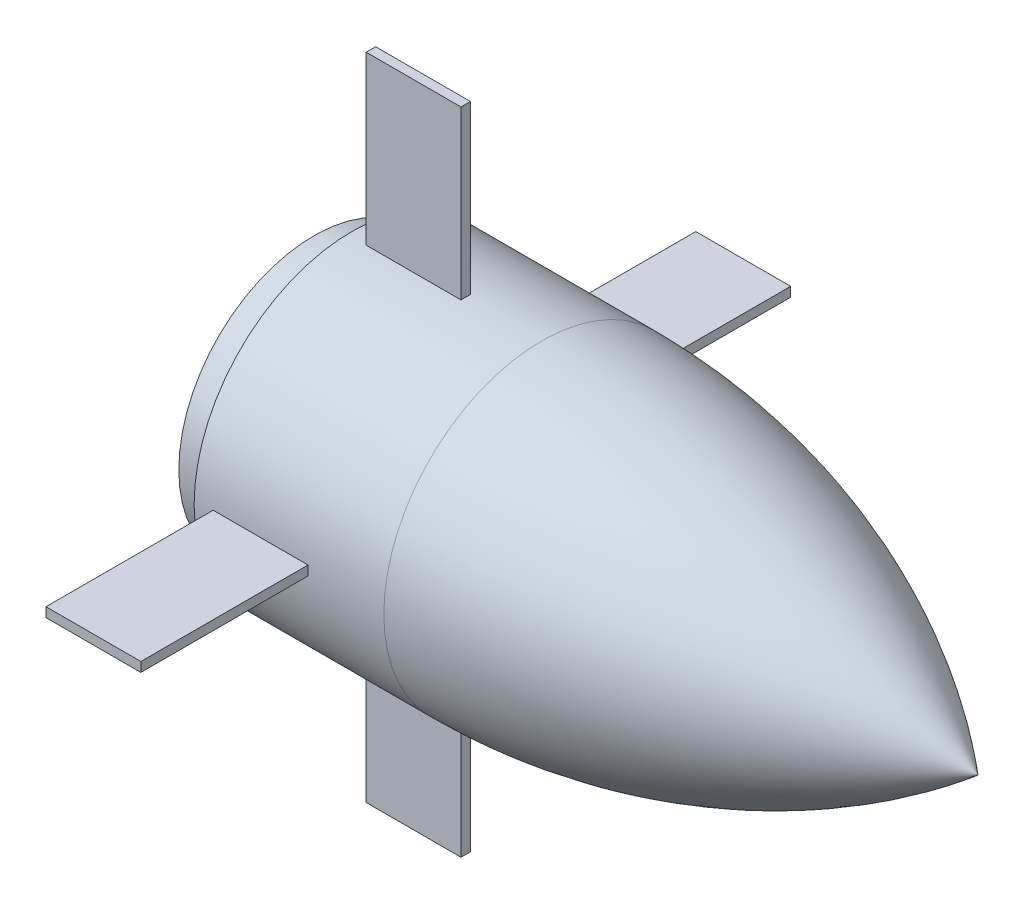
from build123d import *

# Parameters (mm, degrees)
SKETCH3_W           = 5
SKETCH3_H           = 100
BOSS_EXTRUDE1_DEPTH = 50
CIRPATTERN1_COUNT   = 4


with BuildPart() as part:
    # Sketch1 → Revolve1 (revolve)
    with BuildSketch(Plane.XY, mode=Mode.PRIVATE) as revolve1_sk:
        with BuildLine():
            Line((0, 0), (0, 71.25))
            Line((0, 71.25), (20, 71.25))
            Line((20, 71.25), (20, 83.19))
            Line((20, 83.19), (120, 83.19))
            ThreePointArc((120, 83.19), (242.29122628, 61.753457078), (350, 0))
            Line((350, 0), (0, 0))
        make_face()
    revolve(revolve1_sk.sketch.rotate(Axis((0, 0, 0), (1, 0, 0)), 90), axis=Axis((0, 0, 0), (1, 0, 0)))

    # Sketch3 → Boss-Extrude1 (add)
    with BuildSketch(Plane(origin=(30, 0, 0), x_dir=(0, 0, -1), z_dir=(1, 0, 0))):
        with Locations((0, 121.25)):
            Rectangle(SKETCH3_W, SKETCH3_H)
    boss_extrude1 = extrude(amount=BOSS_EXTRUDE1_DEPTH)

    # CirPattern1: Boss-Extrude1 ×4 about axis
    cirpattern1_axis = Axis((0, 0, 0), (1, 0, 0))
    for i in range(1, CIRPATTERN1_COUNT):
        add(boss_extrude1.rotate(cirpattern1_axis, i * 360 / CIRPATTERN1_COUNT))


solid = part.part
